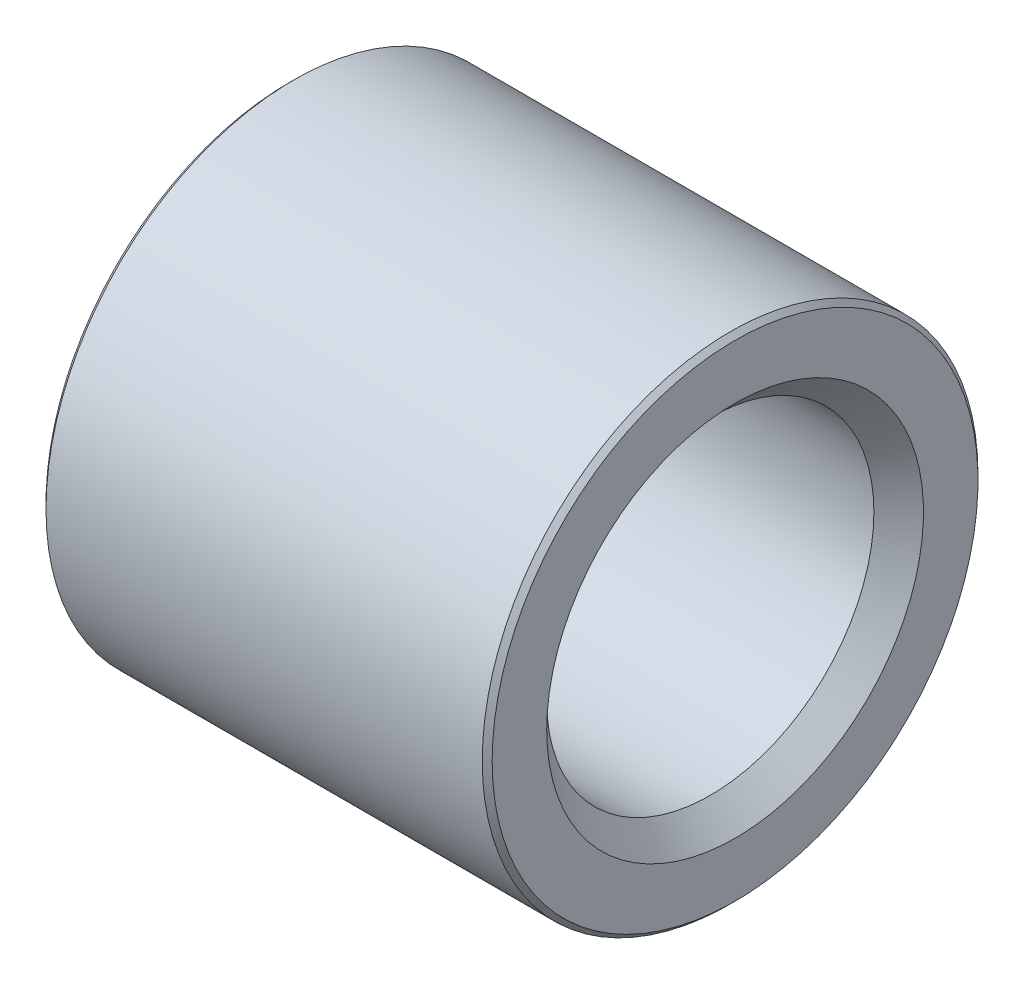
from build123d import *

# Parameters (mm, degrees)
FASE1_SIZE = 0.5


with BuildPart() as part:
    # Skizze1 → Rotation1 (revolve)
    with BuildSketch(Plane.XY, mode=Mode.PRIVATE) as rotation1_sk:
        Polygon((2.5, 16.5), (0, 19), (0, 25), (45, 25), (45, 19), (42.5, 16.5), align=None)
    revolve(rotation1_sk.sketch.rotate(Axis((0, 0, 0), (1, 0, 0)), 90), axis=Axis((0, 0, 0), (1, 0, 0)))

    # Fase1
    fase1_edges = [part.edges().sort_by_distance(p)[0] for p in [
        (45, 0, -25),
        (0, 0, -25),
    ]]
    chamfer(fase1_edges, length=FASE1_SIZE)


solid = part.part
